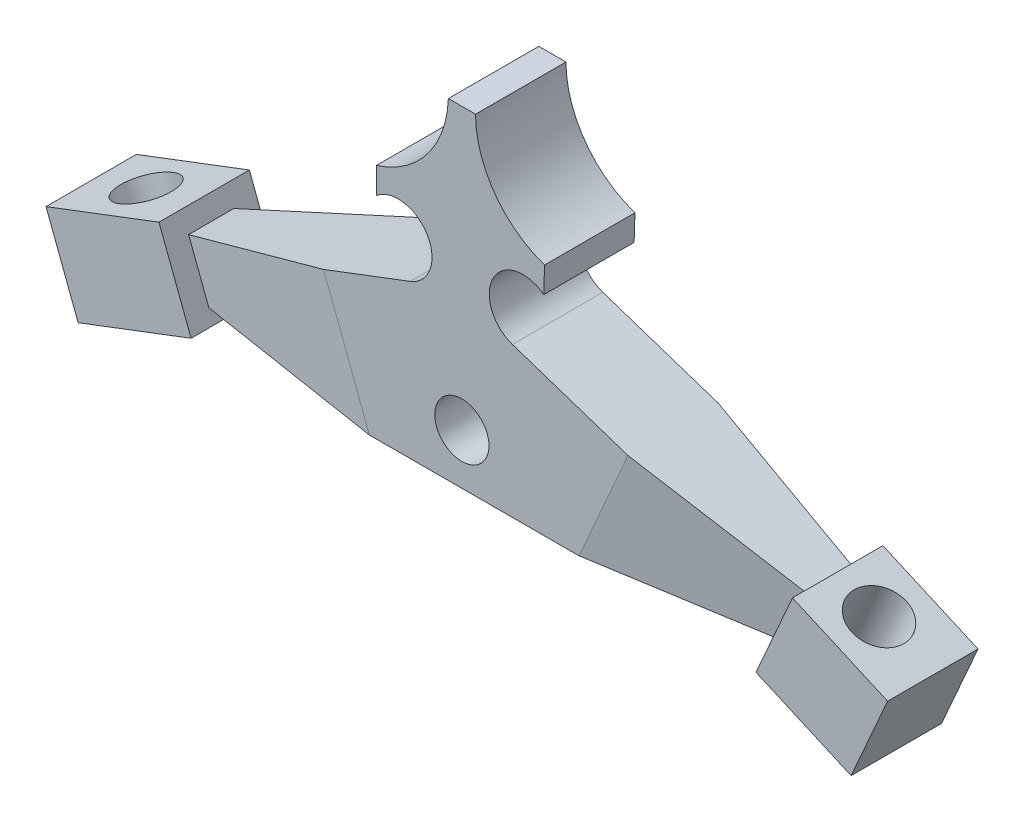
from build123d import *

# Parameters (mm, degrees)
BOSS_EXTRUDE1_DEPTH   = 10
BOSS_EXTRUDE1_2_DEPTH = 10
SKETCH2_R             = 3
BOSS_EXTRUDE7_DEPTH   = 5
BOSS_EXTRUDE8_DEPTH   = 5
CUT_EXTRUDE5_DEPTH    = 15
CUT_EXTRUDE6_DEPTH    = 21
SKETCH12_R            = 3
CUT_EXTRUDE7_DEPTH    = 21
SKETCH13_R            = 3
CUT_EXTRUDE8_DEPTH    = 21
CUT_EXTRUDE10_DEPTH   = 10


with BuildPart() as part:
    # Sketch1 → Boss-Extrude1 (new body)
    with BuildSketch(Plane.XY):
        Polygon((-42.446818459, -10.932400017), (-29.950686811, -6.178076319), (-33.506650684, 3.168319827), (-46.002782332, -1.586003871), align=None)
    extrude(amount=BOSS_EXTRUDE1_DEPTH)



with BuildPart() as body_2:
    # Sketch1 → Boss-Extrude1 2 (new body)
    with BuildSketch(Plane.XY):
        Polygon((32.538592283, -6.93013702), (43.060628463, -11.570907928), (47.096081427, -2.421311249), (36.574045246, 2.219459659), align=None)
    extrude(amount=BOSS_EXTRUDE1_2_DEPTH)


with BuildPart() as body_3:
    # Sketch2 → Boss-Extrude7 (new, symmetric)
    with BuildSketch(Plane.XY.offset(5)):
        with BuildLine():
            Line((1.509852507, 31.01961605), (-1.490147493, 31.01961605))
            ThreePointArc((-1.490147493, 31.01961605), (-3.809551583, 24.554191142), (-9.450488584, 20.634856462))
            Line((-9.450488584, 20.634856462), (-9.450488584, 17.749705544))
            ThreePointArc((-9.450488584, 17.749705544), (-3.817114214, 16.787635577), (-5.710108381, 11.395320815))
            Line((-5.710108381, 11.395320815), (-15.306573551, 7.744214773))
            Line((-15.306573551, 7.744214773), (-8.754164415, -9.477954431))
            Line((-8.754164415, -9.477954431), (11.221748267, -9.477954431))
            Line((11.221748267, -9.477954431), (18.38011639, 6.752238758))
            Line((18.38011639, 6.752238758), (5.59187159, 11.002780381))
            ThreePointArc((5.59187159, 11.002780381), (3.470628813, 16.309456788), (9.057847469, 17.51090304))
            Line((9.057847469, 17.51090304), (9.146679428, 20.394686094))
            ThreePointArc((9.146679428, 20.394686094), (3.629090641, 24.485843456), (1.509852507, 31.01961605))
        make_face()
        Circle(SKETCH2_R, mode=Mode.SUBTRACT)
    extrude(amount=BOSS_EXTRUDE7_DEPTH, both=True)


with BuildPart() as part_1:
    add(part.part)

    add(body_2.part)  # Boss-Extrude8 merges body 2

    add(body_3.part)  # Boss-Extrude8 merges body 3
    # Sketch7 → Boss-Extrude8 (add, symmetric)
    with BuildSketch(Plane.XY.offset(5)):
        Polygon((-15.306573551, 7.744214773), (-32.726092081, 1.116721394), (-30.485834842, -4.771508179), (-10.234307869, -5.587586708), align=None)
        Polygon((18.38011639, 6.752238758), (35.991475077, 0.898596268), (33.44913971, -4.865649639), (12.949396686, -5.560851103), align=None)
    extrude(amount=BOSS_EXTRUDE8_DEPTH, both=True)

    # Sketch8 → Cut-Extrude5 (cut)
    with BuildSketch(Plane(origin=(-4.509322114, 11.852176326, 0), x_dir=(0.9346396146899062, 0.3555963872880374, 0), z_dir=(-0.3555963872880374, 0.9346396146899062, 0))):
        Polygon((-30.19, 0), (-30.19, -2.5), (-11.55231521, 0), align=None)
        Polygon((-30.19, -10), (-11.55231521, -10), (-30.19, -7.5), align=None)
    extrude(amount=-CUT_EXTRUDE5_DEPTH, mode=Mode.SUBTRACT)

    # Sketch11 → Cut-Extrude6 (cut)
    with BuildSketch(Plane(origin=(6.775525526, 15.362172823, 0), x_dir=(0.9149596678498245, -0.4035452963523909, 0), z_dir=(0.40354529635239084, 0.9149596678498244, 0))):
        Polygon((32.568123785, -7.5), (14.092230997, -10), (32.568123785, -10), align=None)
        Polygon((32.568123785, 0), (14.092230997, 0), (32.568123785, -2.5), align=None)
    extrude(amount=-CUT_EXTRUDE6_DEPTH, mode=Mode.SUBTRACT)

    # Sketch12 → Cut-Extrude7 (cut)
    with BuildSketch(Plane(origin=(-5.289880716, 13.90377476, 0), x_dir=(0.9346396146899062, 0.3555963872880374, 0), z_dir=(-0.3555963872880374, 0.9346396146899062, 0))):
        with Locations(Location((-37.06, -5, 0), (0, 0, 180))):
            Circle(SKETCH12_R)
    extrude(amount=-CUT_EXTRUDE7_DEPTH, mode=Mode.SUBTRACT)

    # Sketch13 → Cut-Extrude8 (cut)
    with BuildSketch(Plane(origin=(6.775525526, 15.362172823, 0), x_dir=(0.9149596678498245, -0.4035452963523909, 0), z_dir=(0.40354529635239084, 0.9149596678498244, 0))):
        with Locations(Location((37.568123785, -5, 0), (0, 0, 180))):
            Circle(SKETCH13_R)
    extrude(amount=-CUT_EXTRUDE8_DEPTH, mode=Mode.SUBTRACT)

    # Sketch14 → Cut-Extrude10 (cut)
    with BuildSketch(Plane.XY.offset(10)):
        Polygon((-10.234307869, -5.587586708), (12.949396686, -5.560851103), (11.221748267, -9.477954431), (-8.754164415, -9.477954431), align=None)
    extrude(amount=-CUT_EXTRUDE10_DEPTH, mode=Mode.SUBTRACT)


solid = part_1.part
